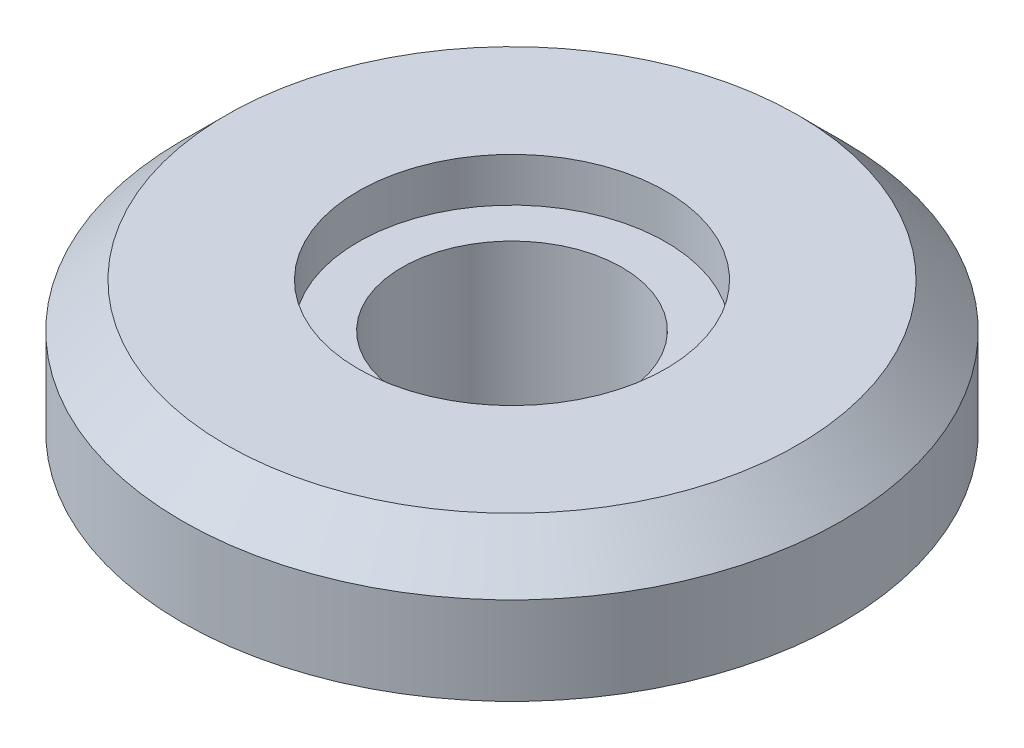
from build123d import *


with BuildPart() as part:
    # Sketch1 → Revolve1 (revolve)
    with BuildSketch(Plane.XY, mode=Mode.PRIVATE) as revolve1_sk:
        Polygon((5, 0), (7.5, 0), (7.5, 5), (15, 5), (15, 9), (13, 11), (7, 11), (7, 9), (5, 9), align=None)
    revolve(revolve1_sk.sketch.rotate(Axis((0, 13.276699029, 0), (0, -1, 0)), 90), axis=Axis((0, 13.276699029, 0), (0, -1, 0)))


solid = part.part
